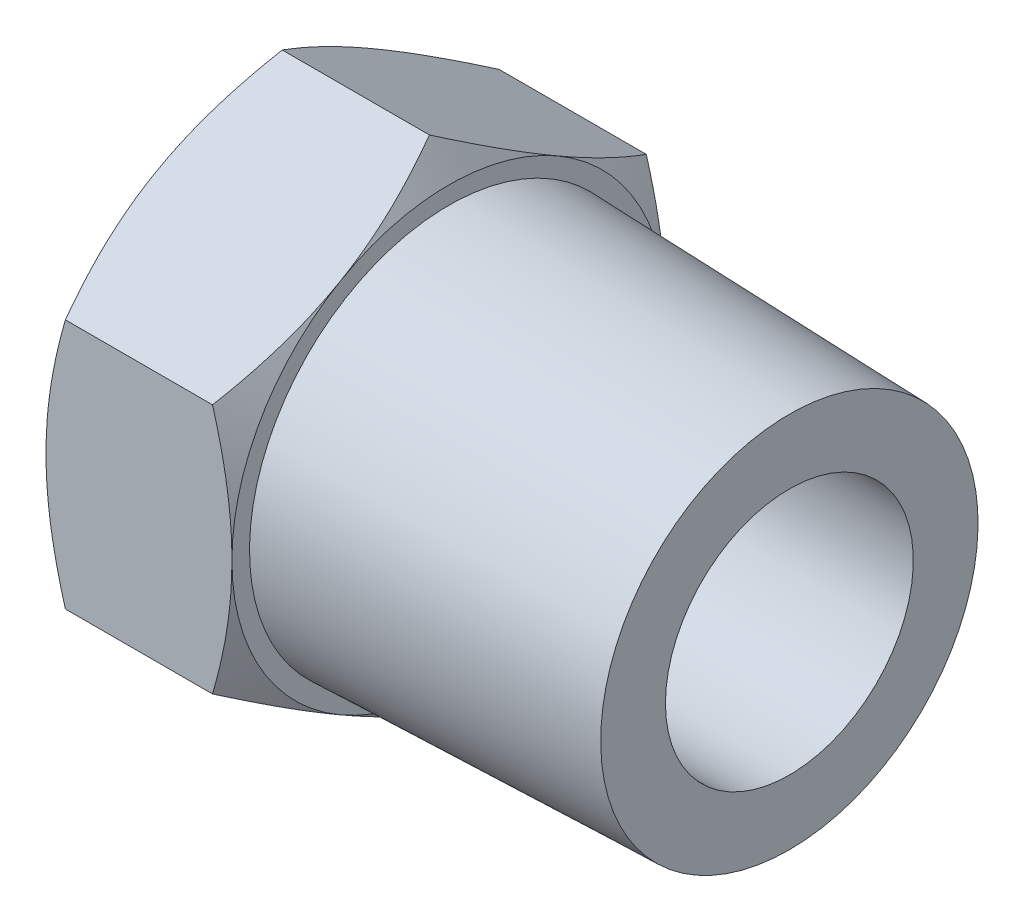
ISO-10303-21;
HEADER;
FILE_DESCRIPTION(('STEP AP214'),'2;1');
FILE_NAME('part.step','',(''),(''),'','','');
FILE_SCHEMA(('AUTOMOTIVE_DESIGN { 1 0 10303 214 1 1 1 1 }'));
ENDSEC;
DATA;
#1=APPLICATION_CONTEXT('core data for automotive mechanical design processes');
#2=APPLICATION_PROTOCOL_DEFINITION('international standard','automotive_design',2000,#1);
#3=PRODUCT_CONTEXT('',#1,'mechanical');
#4=PRODUCT('Part','Part','',(#3));
#5=PRODUCT_RELATED_PRODUCT_CATEGORY('part','',(#4));
#6=PRODUCT_DEFINITION_FORMATION('','',#4);
#7=PRODUCT_DEFINITION_CONTEXT('part definition',#1,'design');
#8=PRODUCT_DEFINITION('design','',#6,#7);
#9=PRODUCT_DEFINITION_SHAPE('','',#8);
#10=(LENGTH_UNIT() NAMED_UNIT(*) SI_UNIT(.MILLI.,.METRE.));
#11=(NAMED_UNIT(*) PLANE_ANGLE_UNIT() SI_UNIT($,.RADIAN.));
#12=(NAMED_UNIT(*) SI_UNIT($,.STERADIAN.) SOLID_ANGLE_UNIT());
#13=UNCERTAINTY_MEASURE_WITH_UNIT(LENGTH_MEASURE(1.E-05),#10,'distance_accuracy_value','');
#14=(GEOMETRIC_REPRESENTATION_CONTEXT(3) GLOBAL_UNCERTAINTY_ASSIGNED_CONTEXT((#13)) GLOBAL_UNIT_ASSIGNED_CONTEXT((#10,
#11,#12)) REPRESENTATION_CONTEXT('',''));
#15=CARTESIAN_POINT('',(0.,0.,0.));
#16=DIRECTION('',(0.,0.,1.));
#17=DIRECTION('',(1.,0.,0.));
#18=AXIS2_PLACEMENT_3D('',#15,#16,#17);
#19=CARTESIAN_POINT('',(13.4874,-4.891175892,4.891175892));
#20=DIRECTION('',(1.,0.,0.));
#21=DIRECTION('',(0.,0.,-1.));
#22=AXIS2_PLACEMENT_3D('',#19,#20,#21);
#23=PLANE('',#22);
#24=CARTESIAN_POINT('',(13.4874,0.,0.));
#25=DIRECTION('',(-1.,0.,0.));
#26=DIRECTION('',(0.,-1.,0.));
#27=AXIS2_PLACEMENT_3D('',#24,#25,#26);
#28=CIRCLE('',#27,4.8331777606);
#29=CARTESIAN_POINT('',(13.4874,-4.8331777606,0.));
#30=VERTEX_POINT('',#29);
#31=EDGE_CURVE('E11',#30,#30,#28,.F.);
#32=ORIENTED_EDGE('',*,*,#31,.T.);
#33=EDGE_LOOP('',(#32));
#34=FACE_BOUND('',#33,.T.);
#35=CARTESIAN_POINT('',(13.4874,0.,0.));
#36=DIRECTION('',(-1.,0.,0.));
#37=DIRECTION('',(0.,0.,1.));
#38=AXIS2_PLACEMENT_3D('',#35,#36,#37);
#39=CIRCLE('',#38,3.175);
#40=CARTESIAN_POINT('',(13.4874,0.,3.175));
#41=VERTEX_POINT('',#40);
#42=EDGE_CURVE('E448',#41,#41,#39,.T.);
#43=ORIENTED_EDGE('',*,*,#42,.T.);
#44=EDGE_LOOP('',(#43));
#45=FACE_BOUND('',#44,.T.);
#46=ADVANCED_FACE('F32',(#34,#45),#23,.T.);
#47=CARTESIAN_POINT('',(4.791075,3.2079024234,5.55625));
#48=DIRECTION('',(0.,0.866025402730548,0.500000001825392));
#49=DIRECTION('',(0.,0.500000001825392,-0.866025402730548));
#50=AXIS2_PLACEMENT_3D('',#47,#48,#49);
#51=PLANE('',#50);
#52=CARTESIAN_POINT('',(4.76250000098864,4.81185364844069,2.7781249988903));
#53=CARTESIAN_POINT('',(4.762522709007,4.87993238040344,2.66020917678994));
#54=CARTESIAN_POINT('',(4.75961098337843,4.94800783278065,2.54229903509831));
#55=CARTESIAN_POINT('',(4.74808744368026,5.08402507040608,2.30671026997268));
#56=CARTESIAN_POINT('',(4.7394767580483,5.15196687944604,2.18903160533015));
#57=CARTESIAN_POINT('',(4.71678077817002,5.28727798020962,1.95466590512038));
#58=CARTESIAN_POINT('',(4.70272304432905,5.35464843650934,1.83797685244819));
#59=CARTESIAN_POINT('',(4.66943535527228,5.4890683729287,1.60515469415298));
#60=CARTESIAN_POINT('',(4.65020526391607,5.5561178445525,1.48902160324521));
#61=CARTESIAN_POINT('',(4.58535052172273,5.75650685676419,1.14193765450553));
#62=CARTESIAN_POINT('',(4.53252991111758,5.88926425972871,0.911995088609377));
#63=CARTESIAN_POINT('',(4.41071207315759,6.15363741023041,0.45408736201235));
#64=CARTESIAN_POINT('',(4.34163405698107,6.28524393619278,0.226138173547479));
#65=CARTESIAN_POINT('',(4.26623574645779,6.41580488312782,-1.8927537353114E-08));
#66=B_SPLINE_CURVE_WITH_KNOTS('',3,(#52,#53,#54,#55,#56,#57,#58,#59,#60,#61,#62,#63,#64,#65),
.UNSPECIFIED.,.F.,.F.,(4,2,2,2,2,2,4),(0.,0.408430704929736,0.81678056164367,1.22309071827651,
1.6294115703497,2.44098831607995,3.25668655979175),.UNSPECIFIED.);
#67=CARTESIAN_POINT('',(4.76250000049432,4.8118536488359,2.77812499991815));
#68=VERTEX_POINT('',#67);
#69=CARTESIAN_POINT('',(4.26623576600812,6.41580484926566,-3.97234481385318E-08));
#70=VERTEX_POINT('',#69);
#71=EDGE_CURVE('E342',#68,#70,#66,.T.);
#72=ORIENTED_EDGE('',*,*,#71,.T.);
#73=DIRECTION('',(1.,0.,0.));
#74=VECTOR('',#73,1.);
#75=CARTESIAN_POINT('',(2.38125,6.4158048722,0.));
#76=LINE('',#75,#74);
#77=CARTESIAN_POINT('',(0.49626424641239,6.4158048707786,2.46192904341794E-09));
#78=VERTEX_POINT('',#77);
#79=EDGE_CURVE('E352',#78,#70,#76,.T.);
#80=ORIENTED_EDGE('',*,*,#79,.F.);
#81=CARTESIAN_POINT('',(0.496264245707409,6.41580486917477,4.85708082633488E-09));
#82=CARTESIAN_POINT('',(0.420865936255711,6.28524392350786,0.226138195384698));
#83=CARTESIAN_POINT('',(0.351787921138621,6.15363739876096,0.45408738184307));
#84=CARTESIAN_POINT('',(0.22997008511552,5.88926425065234,0.911995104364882));
#85=CARTESIAN_POINT('',(0.177149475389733,5.75650684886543,1.14193766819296));
#86=CARTESIAN_POINT('',(0.112294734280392,5.55611783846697,1.48902161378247));
#87=CARTESIAN_POINT('',(0.0930646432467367,5.48906836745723,1.60515470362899));
#88=CARTESIAN_POINT('',(0.0597769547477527,5.35464843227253,1.83797685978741));
#89=CARTESIAN_POINT('',(0.0457192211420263,5.28727797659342,1.95466591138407));
#90=CARTESIAN_POINT('',(0.0230232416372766,5.1519668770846,2.18903160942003));
#91=CARTESIAN_POINT('',(0.0144125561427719,5.08402506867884,2.30671027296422));
#92=CARTESIAN_POINT('',(0.00288901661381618,4.94800783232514,2.5422990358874));
#93=CARTESIAN_POINT('',(-2.27089830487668E-05,4.87993238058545,2.66020917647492));
#94=CARTESIAN_POINT('',(-9.88643838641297E-10,4.81185364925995,2.7781249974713));
#95=B_SPLINE_CURVE_WITH_KNOTS('',3,(#81,#82,#83,#84,#85,#86,#87,#88,#89,#90,#91,#92,#93,#94),
.UNSPECIFIED.,.F.,.F.,(4,2,2,2,2,2,4),(0.,0.815698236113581,1.62727497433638,2.03359582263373,
2.43990597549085,2.84825582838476,3.25668652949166),.UNSPECIFIED.);
#96=CARTESIAN_POINT('',(0.,4.81185364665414,2.77812500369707));
#97=VERTEX_POINT('',#96);
#98=EDGE_CURVE('E384',#78,#97,#95,.T.);
#99=ORIENTED_EDGE('',*,*,#98,.T.);
#100=CARTESIAN_POINT('',(-9.88643837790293E-10,4.81185364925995,2.7781249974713));
#101=CARTESIAN_POINT('',(-2.27093693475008E-05,4.74377491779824,2.89604081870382));
#102=CARTESIAN_POINT('',(0.00288901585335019,4.67569946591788,3.01395095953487));
#103=CARTESIAN_POINT('',(0.0144125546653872,4.53968222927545,3.2495397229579));
#104=CARTESIAN_POINT('',(0.0230232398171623,4.47174042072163,3.36721838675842));
#105=CARTESIAN_POINT('',(0.0457192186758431,4.33642932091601,3.60158408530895));
#106=CARTESIAN_POINT('',(0.0597769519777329,4.26905886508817,3.71827313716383));
#107=CARTESIAN_POINT('',(0.0930646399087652,4.13463892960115,3.95109529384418));
#108=CARTESIAN_POINT('',(0.112294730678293,4.06758945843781,4.0672283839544));
#109=CARTESIAN_POINT('',(0.177149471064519,3.86720044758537,4.41431233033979));
#110=CARTESIAN_POINT('',(0.229970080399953,3.73444304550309,4.64425489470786));
#111=CARTESIAN_POINT('',(0.351787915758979,3.4700698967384,5.1021626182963));
#112=CARTESIAN_POINT('',(0.420865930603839,3.33846337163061,5.33011180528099));
#113=CARTESIAN_POINT('',(0.496264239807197,3.20790242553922,5.55624999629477));
#114=B_SPLINE_CURVE_WITH_KNOTS('',3,(#100,#101,#102,#103,#104,#105,#106,#107,#108,#109,#110,
#111,#112,#113),.UNSPECIFIED.,.F.,.F.,(4,2,2,2,2,2,4),(0.,0.408430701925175,0.816780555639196,
1.22309070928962,1.62941155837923,2.44098829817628,3.25668653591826),.UNSPECIFIED.);
#115=CARTESIAN_POINT('',(0.496264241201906,3.20790242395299,5.55625));
#116=VERTEX_POINT('',#115);
#117=EDGE_CURVE('E205',#97,#116,#114,.T.);
#118=ORIENTED_EDGE('',*,*,#117,.T.);
#119=DIRECTION('',(-1.,0.,0.));
#120=VECTOR('',#119,1.);
#121=CARTESIAN_POINT('',(2.38125,3.2079024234,5.55625));
#122=LINE('',#121,#120);
#123=CARTESIAN_POINT('',(4.26623578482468,3.20790246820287,5.55624992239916));
#124=VERTEX_POINT('',#123);
#125=EDGE_CURVE('E127',#124,#116,#122,.T.);
#126=ORIENTED_EDGE('',*,*,#125,.F.);
#127=CARTESIAN_POINT('',(4.26623581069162,3.20790251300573,5.55624984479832));
#128=CARTESIAN_POINT('',(4.34163411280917,3.33846345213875,5.3301116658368));
#129=CARTESIAN_POINT('',(4.41071212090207,3.47006997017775,5.10216249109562));
#130=CARTESIAN_POINT('',(4.53252994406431,3.73444310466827,4.64425479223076));
#131=CARTESIAN_POINT('',(4.58535054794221,3.86720049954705,4.41431224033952));
#132=CARTESIAN_POINT('',(4.65020528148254,4.06758949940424,4.06722831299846));
#133=CARTESIAN_POINT('',(4.66943537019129,4.13463896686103,3.95109522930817));
#134=CARTESIAN_POINT('',(4.70272305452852,4.26905889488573,3.71827308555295));
#135=CARTESIAN_POINT('',(4.71678078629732,4.3364293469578,3.60158404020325));
#136=CARTESIAN_POINT('',(4.73947676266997,4.47174043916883,3.36721835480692));
#137=CARTESIAN_POINT('',(4.74808744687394,4.53968224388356,3.24953969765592));
#138=CARTESIAN_POINT('',(4.7596109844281,4.67569947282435,3.01395094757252));
#139=CARTESIAN_POINT('',(4.7625227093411,4.74377492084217,2.8960408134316));
#140=CARTESIAN_POINT('',(4.76250000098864,4.81185364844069,2.7781249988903));
#141=B_SPLINE_CURVE_WITH_KNOTS('',3,(#127,#128,#129,#130,#131,#132,#133,#134,#135,#136,#137,
#138,#139,#140),.UNSPECIFIED.,.F.,.F.,(4,2,2,2,2,2,4),(0.,0.815698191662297,1.62727488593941,
2.03359571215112,2.43990584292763,2.84825567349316,3.25668635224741),.UNSPECIFIED.);
#142=EDGE_CURVE('E337',#124,#68,#141,.T.);
#143=ORIENTED_EDGE('',*,*,#142,.T.);
#144=EDGE_LOOP('',(#72,#80,#99,#118,#126,#143));
#145=FACE_BOUND('',#144,.T.);
#146=ADVANCED_FACE('F311',(#145),#51,.T.);
#147=CARTESIAN_POINT('',(4.791075,6.4158048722,0.));
#148=DIRECTION('',(0.,0.866025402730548,-0.500000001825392));
#149=DIRECTION('',(0.,-0.500000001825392,-0.866025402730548));
#150=AXIS2_PLACEMENT_3D('',#147,#148,#149);
#151=PLANE('',#150);
#152=CARTESIAN_POINT('',(4.76250000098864,4.81185364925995,-2.7781249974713));
#153=CARTESIAN_POINT('',(4.76252270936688,4.74377491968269,-2.89604081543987));
#154=CARTESIAN_POINT('',(4.75961098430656,4.67569946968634,-3.01395095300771));
#155=CARTESIAN_POINT('',(4.74808744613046,4.53968223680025,-3.24953970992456));
#156=CARTESIAN_POINT('',(4.73947676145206,4.47174043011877,-3.36721837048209));
#157=CARTESIAN_POINT('',(4.7167807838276,4.33642933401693,-3.60158406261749));
#158=CARTESIAN_POINT('',(4.70272305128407,4.26905888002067,-3.71827311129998));
#159=CARTESIAN_POINT('',(4.66943536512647,4.13463894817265,-3.95109526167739));
#160=CARTESIAN_POINT('',(4.65020527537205,4.06758947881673,-4.06722834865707));
#161=CARTESIAN_POINT('',(4.58535053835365,3.86720047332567,-4.41431228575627));
#162=CARTESIAN_POINT('',(4.53252993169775,3.73444307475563,-4.64425484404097));
#163=CARTESIAN_POINT('',(4.41071210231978,3.4700699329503,-5.10216255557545));
#164=CARTESIAN_POINT('',(4.34163409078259,3.33846341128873,-5.33011173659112));
#165=CARTESIAN_POINT('',(4.26623578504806,3.20790246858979,-5.55624992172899));
#166=B_SPLINE_CURVE_WITH_KNOTS('',3,(#152,#153,#154,#155,#156,#157,#158,#159,#160,#161,#162,
#163,#164,#165),.UNSPECIFIED.,.F.,.F.,(4,2,2,2,2,2,4),(0.,0.40843069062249,0.816780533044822,
1.22309067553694,1.62941151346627,2.44098823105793,3.25668644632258),.UNSPECIFIED.);
#167=CARTESIAN_POINT('',(4.76250000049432,4.81185365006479,-2.77812499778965));
#168=VERTEX_POINT('',#167);
#169=CARTESIAN_POINT('',(4.26623575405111,3.20790244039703,-5.55625));
#170=VERTEX_POINT('',#169);
#171=EDGE_CURVE('E297',#168,#170,#166,.T.);
#172=ORIENTED_EDGE('',*,*,#171,.T.);
#173=DIRECTION('',(1.,0.,0.));
#174=VECTOR('',#173,1.);
#175=CARTESIAN_POINT('',(2.38125,3.2079024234,-5.55625));
#176=LINE('',#175,#174);
#177=CARTESIAN_POINT('',(0.496264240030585,3.2079024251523,-5.55624999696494));
#178=VERTEX_POINT('',#177);
#179=EDGE_CURVE('E387',#178,#170,#176,.T.);
#180=ORIENTED_EDGE('',*,*,#179,.F.);
#181=CARTESIAN_POINT('',(0.496264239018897,3.20790242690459,-5.55624999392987));
#182=CARTESIAN_POINT('',(0.420865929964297,3.33846337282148,-5.33011180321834));
#183=CARTESIAN_POINT('',(0.351787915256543,3.47006989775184,-5.10216261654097));
#184=CARTESIAN_POINT('',(0.229970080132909,3.73444304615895,-4.64425489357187));
#185=CARTESIAN_POINT('',(0.177149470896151,3.86720044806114,-4.41431232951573));
#186=CARTESIAN_POINT('',(0.112294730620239,4.06758945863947,-4.0672283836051));
#187=CARTESIAN_POINT('',(0.0930646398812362,4.13463892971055,-3.95109529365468));
#188=CARTESIAN_POINT('',(0.0597769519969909,4.26905886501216,-3.71827313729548));
#189=CARTESIAN_POINT('',(0.0457192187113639,4.33642932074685,-3.60158408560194));
#190=CARTESIAN_POINT('',(0.0230232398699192,4.47174042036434,-3.36721838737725));
#191=CARTESIAN_POINT('',(0.014412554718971,4.53968222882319,-3.24953972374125));
#192=CARTESIAN_POINT('',(0.00288901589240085,4.67569946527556,-3.0139509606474));
#193=CARTESIAN_POINT('',(-2.27093456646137E-05,4.74377491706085,-2.89604081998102));
#194=CARTESIAN_POINT('',(-9.88643837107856E-10,4.81185364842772,-2.77812499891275));
#195=B_SPLINE_CURVE_WITH_KNOTS('',3,(#181,#182,#183,#184,#185,#186,#187,#188,#189,#190,#191,
#192,#193,#194),.UNSPECIFIED.,.F.,.F.,(4,2,2,2,2,2,4),(0.,0.815698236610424,1.62727497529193,
2.03359582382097,2.43990597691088,2.84825583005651,3.25668653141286),.UNSPECIFIED.);
#196=CARTESIAN_POINT('',(-4.94322106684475E-10,4.81185364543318,-2.77812500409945));
#197=VERTEX_POINT('',#196);
#198=EDGE_CURVE('E317',#178,#197,#195,.T.);
#199=ORIENTED_EDGE('',*,*,#198,.T.);
#200=CARTESIAN_POINT('',(-9.88643962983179E-10,4.81185364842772,-2.77812499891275));
#201=CARTESIAN_POINT('',(-2.27090066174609E-05,4.87993237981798,-2.66020917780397));
#202=CARTESIAN_POINT('',(0.00288901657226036,4.94800783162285,-2.54229903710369));
#203=CARTESIAN_POINT('',(0.0144125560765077,5.08402506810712,-2.30671027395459));
#204=CARTESIAN_POINT('',(0.0230232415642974,5.15196687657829,-2.18903161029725));
#205=CARTESIAN_POINT('',(0.045719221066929,5.28727797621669,-1.95466591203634));
#206=CARTESIAN_POINT('',(0.0597769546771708,5.35464843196,-1.83797686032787));
#207=CARTESIAN_POINT('',(0.0930646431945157,5.48906836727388,-1.60515470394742));
#208=CARTESIAN_POINT('',(0.112294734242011,5.55611783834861,-1.48902161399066));
#209=CARTESIAN_POINT('',(0.1771494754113,5.75650684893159,-1.14193766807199));
#210=CARTESIAN_POINT('',(0.229970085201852,5.88926425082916,-0.911995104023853));
#211=CARTESIAN_POINT('',(0.351787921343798,6.15363739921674,-0.454087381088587));
#212=CARTESIAN_POINT('',(0.420865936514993,6.28524392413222,-0.226138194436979));
#213=CARTESIAN_POINT('',(0.496264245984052,6.4158048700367,-3.74694415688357E-09));
#214=B_SPLINE_CURVE_WITH_KNOTS('',3,(#200,#201,#202,#203,#204,#205,#206,#207,#208,#209,#210,
#211,#212,#213),.UNSPECIFIED.,.F.,.F.,(4,2,2,2,2,2,4),(0.,0.408430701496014,0.816780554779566,
1.22309070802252,1.62941155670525,2.44098829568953,3.25668653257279),.UNSPECIFIED.);
#215=EDGE_CURVE('E204',#197,#78,#214,.T.);
#216=ORIENTED_EDGE('',*,*,#215,.T.);
#217=ORIENTED_EDGE('',*,*,#79,.T.);
#218=CARTESIAN_POINT('',(4.26623578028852,6.41580482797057,-8.00469063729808E-08));
#219=CARTESIAN_POINT('',(4.34163408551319,6.28524388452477,-0.226138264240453));
#220=CARTESIAN_POINT('',(4.41071209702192,6.15363736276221,-0.454087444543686));
#221=CARTESIAN_POINT('',(4.53252992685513,5.88926422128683,-0.911995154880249));
#222=CARTESIAN_POINT('',(4.58535053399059,5.7565068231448,-1.14193771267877));
#223=CARTESIAN_POINT('',(4.6502052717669,5.55611781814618,-1.48902164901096));
#224=CARTESIAN_POINT('',(4.66943536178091,5.48906834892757,-1.60515473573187));
#225=CARTESIAN_POINT('',(4.70272304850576,5.35464841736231,-1.83797688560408));
#226=CARTESIAN_POINT('',(4.71678078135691,5.28727796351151,-1.95466593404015));
#227=CARTESIAN_POINT('',(4.73947675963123,5.15196686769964,-2.18903162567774));
#228=CARTESIAN_POINT('',(4.74808744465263,5.08402506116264,-2.3067102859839));
#229=CARTESIAN_POINT('',(4.75961098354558,4.94800782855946,-2.54229904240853));
#230=CARTESIAN_POINT('',(4.76252270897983,4.87993237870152,-2.66020917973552));
#231=CARTESIAN_POINT('',(4.76250000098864,4.81185364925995,-2.7781249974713));
#232=B_SPLINE_CURVE_WITH_KNOTS('',3,(#218,#219,#220,#221,#222,#223,#224,#225,#226,#227,#228,
#229,#230,#231),.UNSPECIFIED.,.F.,.F.,(4,2,2,2,2,2,4),(0.,0.815698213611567,1.62727492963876,
2.03359576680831,2.43990590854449,2.8482557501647,3.25668643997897),.UNSPECIFIED.);
#233=EDGE_CURVE('E303',#70,#168,#232,.T.);
#234=ORIENTED_EDGE('',*,*,#233,.T.);
#235=EDGE_LOOP('',(#172,#180,#199,#216,#217,#234));
#236=FACE_BOUND('',#235,.T.);
#237=ADVANCED_FACE('F308',(#236),#151,.T.);
#238=CARTESIAN_POINT('',(4.791075,-3.2079024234,-5.55625));
#239=DIRECTION('',(0.,0.,-1.));
#240=DIRECTION('',(-1.,0.,0.));
#241=AXIS2_PLACEMENT_3D('',#238,#239,#240);
#242=PLANE('',#241);
#243=CARTESIAN_POINT('',(4.7625,-1.13960469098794E-09,-5.55625));
#244=CARTESIAN_POINT('',(4.76252270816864,-0.136157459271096,-5.55625));
#245=CARTESIAN_POINT('',(4.75961098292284,-0.27230835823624,-5.55625));
#246=CARTESIAN_POINT('',(4.74808744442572,-0.544342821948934,-5.55625));
#247=CARTESIAN_POINT('',(4.73947675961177,-0.680226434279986,-5.55625));
#248=CARTESIAN_POINT('',(4.71678078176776,-0.950848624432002,-5.55625));
#249=CARTESIAN_POINT('',(4.70272304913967,-1.08558953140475,-5.55625));
#250=CARTESIAN_POINT('',(4.66943536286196,-1.35442939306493,-5.55625));
#251=CARTESIAN_POINT('',(4.65020527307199,-1.48852833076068,-5.55625));
#252=CARTESIAN_POINT('',(4.58535053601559,-1.88930633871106,-5.55625));
#253=CARTESIAN_POINT('',(4.53252992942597,-2.1548211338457,-5.55625));
#254=CARTESIAN_POINT('',(4.41071210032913,-2.683567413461,-5.55625));
#255=CARTESIAN_POINT('',(4.34163408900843,-2.94678045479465,-5.55625));
#256=CARTESIAN_POINT('',(4.26623578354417,-3.20790233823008,-5.55625));
#257=B_SPLINE_CURVE_WITH_KNOTS('',3,(#243,#244,#245,#246,#247,#248,#249,#250,#251,#252,#253,
#254,#255,#256),.UNSPECIFIED.,.F.,.F.,(4,2,2,2,2,2,4),(0.,0.408430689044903,0.816780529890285,
1.22309067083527,1.62941150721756,2.44098822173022,3.2566864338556),.UNSPECIFIED.);
#258=CARTESIAN_POINT('',(4.7625,-1.70940703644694E-09,-5.55625));
#259=VERTEX_POINT('',#258);
#260=CARTESIAN_POINT('',(4.2662357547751,-3.20790241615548,-5.55625001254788));
#261=VERTEX_POINT('',#260);
#262=EDGE_CURVE('E271',#259,#261,#257,.T.);
#263=ORIENTED_EDGE('',*,*,#262,.T.);
#264=DIRECTION('',(1.,0.,0.));
#265=VECTOR('',#264,1.);
#266=CARTESIAN_POINT('',(2.38125,-3.2079024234,-5.55625));
#267=LINE('',#266,#265);
#268=CARTESIAN_POINT('',(0.496264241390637,-3.20790242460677,-5.55625));
#269=VERTEX_POINT('',#268);
#270=EDGE_CURVE('E392',#269,#261,#267,.T.);
#271=ORIENTED_EDGE('',*,*,#270,.F.);
#272=CARTESIAN_POINT('',(0.496264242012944,-3.20790242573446,-5.55624999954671));
#273=CARTESIAN_POINT('',(0.420865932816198,-2.94678053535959,-5.55624999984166));
#274=CARTESIAN_POINT('',(0.351787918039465,-2.68356748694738,-5.55624999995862));
#275=CARTESIAN_POINT('',(0.229970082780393,-2.15482119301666,-5.55625000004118));
#276=CARTESIAN_POINT('',(0.177149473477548,-1.88930639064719,-5.55625000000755));
#277=CARTESIAN_POINT('',(0.112294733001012,-1.48852837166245,-5.55624999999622));
#278=CARTESIAN_POINT('',(0.0930646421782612,-1.35442943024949,-5.55624999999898));
#279=CARTESIAN_POINT('',(0.0597769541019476,-1.08558956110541,-5.55625000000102));
#280=CARTESIAN_POINT('',(0.0457192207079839,-0.950848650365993,-5.55625000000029));
#281=CARTESIAN_POINT('',(0.023023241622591,-0.68022645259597,-5.55624999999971));
#282=CARTESIAN_POINT('',(0.0144125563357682,-0.544342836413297,-5.55624999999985));
#283=CARTESIAN_POINT('',(0.00288901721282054,-0.272308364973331,-5.55625000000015));
#284=CARTESIAN_POINT('',(-2.27081857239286E-05,-0.136157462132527,-5.55625000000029));
#285=CARTESIAN_POINT('',(0.,-1.24729537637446E-10,-5.55625));
#286=B_SPLINE_CURVE_WITH_KNOTS('',3,(#272,#273,#274,#275,#276,#277,#278,#279,#280,#281,#282,
#283,#284,#285),.UNSPECIFIED.,.F.,.F.,(4,2,2,2,2,2,4),(0.,0.815698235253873,1.62727497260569,
2.03359582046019,2.43990597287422,2.84825582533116,3.25668652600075),.UNSPECIFIED.);
#287=CARTESIAN_POINT('',(0.,-6.23646473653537E-11,-5.55625));
#288=VERTEX_POINT('',#287);
#289=EDGE_CURVE('E124',#269,#288,#286,.T.);
#290=ORIENTED_EDGE('',*,*,#289,.T.);
#291=CARTESIAN_POINT('',(0.,-1.24729294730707E-10,-5.55625));
#292=CARTESIAN_POINT('',(-2.27081891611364E-05,0.13615746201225,-5.55625));
#293=CARTESIAN_POINT('',(0.00288901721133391,0.272308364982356,-5.55625));
#294=CARTESIAN_POINT('',(0.0144125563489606,0.544342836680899,-5.55625));
#295=CARTESIAN_POINT('',(0.023023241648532,0.680226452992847,-5.55625));
#296=CARTESIAN_POINT('',(0.0457192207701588,0.950848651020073,-5.55625));
#297=CARTESIAN_POINT('',(0.0597769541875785,1.08558956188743,-5.55625));
#298=CARTESIAN_POINT('',(0.0930646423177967,1.35442943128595,-5.55625));
#299=CARTESIAN_POINT('',(0.112294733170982,1.48852837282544,-5.55625));
#300=CARTESIAN_POINT('',(0.177149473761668,1.88930639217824,-5.55625));
#301=CARTESIAN_POINT('',(0.229970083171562,2.1548211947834,-5.55625));
#302=CARTESIAN_POINT('',(0.351787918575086,2.68356748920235,-5.55625));
#303=CARTESIAN_POINT('',(0.420865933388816,2.94678053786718,-5.55625));
#304=CARTESIAN_POINT('',(0.496264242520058,3.2079024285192,-5.55625));
#305=B_SPLINE_CURVE_WITH_KNOTS('',3,(#291,#292,#293,#294,#295,#296,#297,#298,#299,#300,#301,
#302,#303,#304),.UNSPECIFIED.,.F.,.F.,(4,2,2,2,2,2,4),(0.,0.408430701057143,0.816780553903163,
1.22309070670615,1.6294115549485,2.44098829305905,3.2566865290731),.UNSPECIFIED.);
#306=EDGE_CURVE('E323',#288,#178,#305,.T.);
#307=ORIENTED_EDGE('',*,*,#306,.T.);
#308=ORIENTED_EDGE('',*,*,#179,.T.);
#309=CARTESIAN_POINT('',(4.26623572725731,3.20790245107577,-5.55624996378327));
#310=CARTESIAN_POINT('',(4.34163405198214,2.94678056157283,-5.55624998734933));
#311=CARTESIAN_POINT('',(4.41071207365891,2.68356751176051,-5.55624999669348));
#312=CARTESIAN_POINT('',(4.5325299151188,2.15482121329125,-5.55625000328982));
#313=CARTESIAN_POINT('',(4.5853505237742,1.88930640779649,-5.55625000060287));
#314=CARTESIAN_POINT('',(4.65020526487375,1.4885283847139,-5.55624999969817));
#315=CARTESIAN_POINT('',(4.66943535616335,1.3544294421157,-5.55624999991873));
#316=CARTESIAN_POINT('',(4.70272304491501,1.08558957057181,-5.55625000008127));
#317=CARTESIAN_POINT('',(4.71678077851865,0.950848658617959,-5.55625000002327));
#318=CARTESIAN_POINT('',(4.73947675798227,0.68022645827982,-5.55624999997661));
#319=CARTESIAN_POINT('',(4.748087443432,0.544342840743,-5.55624999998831));
#320=CARTESIAN_POINT('',(4.75961098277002,0.272308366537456,-5.5562500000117));
#321=CARTESIAN_POINT('',(4.76252270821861,0.136157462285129,-5.5562500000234));
#322=CARTESIAN_POINT('',(4.7625,-1.13960505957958E-09,-5.55625));
#323=B_SPLINE_CURVE_WITH_KNOTS('',3,(#309,#310,#311,#312,#313,#314,#315,#316,#317,#318,#319,
#320,#321,#322),.UNSPECIFIED.,.F.,.F.,(4,2,2,2,2,2,4),(0.,0.815698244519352,1.62727499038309,
2.03359584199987,2.43990599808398,2.84825585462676,3.25668655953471),.UNSPECIFIED.);
#324=EDGE_CURVE('E292',#170,#259,#323,.T.);
#325=ORIENTED_EDGE('',*,*,#324,.T.);
#326=EDGE_LOOP('',(#263,#271,#290,#307,#308,#325));
#327=FACE_BOUND('',#326,.T.);
#328=ADVANCED_FACE('F253',(#327),#242,.T.);
#329=CARTESIAN_POINT('',(4.791075,-3.2079024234,-5.55625));
#330=DIRECTION('',(0.,-0.866025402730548,-0.500000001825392));
#331=DIRECTION('',(0.,-0.500000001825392,0.866025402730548));
#332=AXIS2_PLACEMENT_3D('',#329,#330,#331);
#333=PLANE('',#332);
#334=CARTESIAN_POINT('',(4.76250000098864,-4.81185364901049,-2.77812499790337));
#335=CARTESIAN_POINT('',(4.76252270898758,-4.87993237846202,-2.66020918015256));
#336=CARTESIAN_POINT('',(4.75961098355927,-4.94800782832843,-2.54229904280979));
#337=CARTESIAN_POINT('',(4.74808744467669,-5.08402506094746,-2.3067102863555));
#338=CARTESIAN_POINT('',(4.73947675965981,-5.15196686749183,-2.18903162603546));
#339=CARTESIAN_POINT('',(4.71678078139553,-5.28727796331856,-1.95466593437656));
#340=CARTESIAN_POINT('',(4.70272304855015,-5.35464841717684,-1.83797688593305));
#341=CARTESIAN_POINT('',(4.66943536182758,-5.48906834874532,-1.60515473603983));
#342=CARTESIAN_POINT('',(4.65020527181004,-5.55611781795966,-1.48902164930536));
#343=CARTESIAN_POINT('',(4.58535053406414,-5.75650682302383,-1.14193771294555));
#344=CARTESIAN_POINT('',(4.53252992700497,-5.88926422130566,-0.911995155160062));
#345=CARTESIAN_POINT('',(4.41071209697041,-6.15363736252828,-0.45408744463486));
#346=CARTESIAN_POINT('',(4.34163408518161,-6.28524388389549,-0.226138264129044));
#347=CARTESIAN_POINT('',(4.26623577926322,-6.41580482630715,-7.94887462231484E-08));
#348=B_SPLINE_CURVE_WITH_KNOTS('',3,(#334,#335,#336,#337,#338,#339,#340,#341,#342,#343,#344,
#345,#346,#347),.UNSPECIFIED.,.F.,.F.,(4,2,2,2,2,2,4),(0.,0.408430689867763,0.816780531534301,
1.22309067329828,1.62941151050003,2.44098822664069,3.25668644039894),.UNSPECIFIED.);
#349=CARTESIAN_POINT('',(4.76250000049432,-4.81185364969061,-2.77812499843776));
#350=VERTEX_POINT('',#349);
#351=CARTESIAN_POINT('',(4.26623574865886,-6.41580487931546,-1.23243365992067E-08));
#352=VERTEX_POINT('',#351);
#353=EDGE_CURVE('E258',#350,#352,#348,.T.);
#354=ORIENTED_EDGE('',*,*,#353,.T.);
#355=DIRECTION('',(1.,0.,0.));
#356=VECTOR('',#355,1.);
#357=CARTESIAN_POINT('',(2.38125,-6.4158048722,0.));
#358=LINE('',#357,#356);
#359=CARTESIAN_POINT('',(0.496264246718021,-6.41580487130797,-1.54503742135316E-09));
#360=VERTEX_POINT('',#359);
#361=EDGE_CURVE('E146',#360,#352,#358,.T.);
#362=ORIENTED_EDGE('',*,*,#361,.F.);
#363=CARTESIAN_POINT('',(0.496264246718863,-6.41580486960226,-2.79224623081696E-09));
#364=CARTESIAN_POINT('',(0.420865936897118,-6.28524392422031,-0.226138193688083));
#365=CARTESIAN_POINT('',(0.351787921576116,-6.15363739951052,-0.454087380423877));
#366=CARTESIAN_POINT('',(0.229970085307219,-5.88926425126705,-0.911995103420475));
#367=CARTESIAN_POINT('',(0.177149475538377,-5.75650684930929,-1.14193766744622));
#368=CARTESIAN_POINT('',(0.11229473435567,-5.55611783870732,-1.48902161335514));
#369=CARTESIAN_POINT('',(0.0930646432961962,-5.48906836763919,-1.60515470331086));
#370=CARTESIAN_POINT('',(0.0597769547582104,-5.35464843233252,-1.83797685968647));
#371=CARTESIAN_POINT('',(0.0457192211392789,-5.28727797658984,-1.95466591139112));
#372=CARTESIAN_POINT('',(0.0230232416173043,-5.15196687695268,-2.18903160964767));
#373=CARTESIAN_POINT('',(0.0144125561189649,-5.08402506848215,-2.30671027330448));
#374=CARTESIAN_POINT('',(0.00288901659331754,-4.94800783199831,-2.54229903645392));
#375=CARTESIAN_POINT('',(-2.27089963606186E-05,-4.87993238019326,-2.66020917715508));
#376=CARTESIAN_POINT('',(-9.88643713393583E-10,-4.81185364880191,-2.77812499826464));
#377=B_SPLINE_CURVE_WITH_KNOTS('',3,(#363,#364,#365,#366,#367,#368,#369,#370,#371,#372,#373,
#374,#375,#376),.UNSPECIFIED.,.F.,.F.,(4,2,2,2,2,2,4),(0.,0.815698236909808,1.62727497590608,
2.03359582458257,2.4399059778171,2.84825583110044,3.25668653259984),.UNSPECIFIED.);
#378=CARTESIAN_POINT('',(-4.94321981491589E-10,-4.81185364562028,-2.77812500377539));
#379=VERTEX_POINT('',#378);
#380=EDGE_CURVE('E143',#360,#379,#377,.T.);
#381=ORIENTED_EDGE('',*,*,#380,.T.);
#382=CARTESIAN_POINT('',(-9.88643587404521E-10,-4.81185364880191,-2.77812499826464));
#383=CARTESIAN_POINT('',(-2.27093563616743E-05,-4.74377491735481,-2.89604081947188));
#384=CARTESIAN_POINT('',(0.00288901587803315,-4.67569946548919,-3.01395096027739));
#385=CARTESIAN_POINT('',(0.0144125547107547,-4.53968222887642,-3.24953972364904));
#386=CARTESIAN_POINT('',(0.0230232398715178,-4.47174042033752,-3.3672183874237));
#387=CARTESIAN_POINT('',(0.045719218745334,-4.33642932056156,-3.60158408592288));
#388=CARTESIAN_POINT('',(0.0597769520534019,-4.26905886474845,-3.71827313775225));
#389=CARTESIAN_POINT('',(0.0930646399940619,-4.13463892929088,-3.95109529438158));
#390=CARTESIAN_POINT('',(0.112294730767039,-4.06758945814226,-4.0672283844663));
#391=CARTESIAN_POINT('',(0.177149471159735,-3.86720044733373,-4.41431233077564));
#392=CARTESIAN_POINT('',(0.229970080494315,-3.7344430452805,-4.64425489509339));
#393=CARTESIAN_POINT('',(0.351787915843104,-3.47006989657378,-5.10216261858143));
#394=CARTESIAN_POINT('',(0.420865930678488,-3.3384633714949,-5.33011180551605));
#395=CARTESIAN_POINT('',(0.496264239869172,-3.20790242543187,-5.5562499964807));
#396=B_SPLINE_CURVE_WITH_KNOTS('',3,(#382,#383,#384,#385,#386,#387,#388,#389,#390,#391,#392,
#393,#394,#395),.UNSPECIFIED.,.F.,.F.,(4,2,2,2,2,2,4),(0.,0.408430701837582,0.816780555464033,
1.22309070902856,1.62941155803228,2.44098829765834,3.25668653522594),.UNSPECIFIED.);
#397=EDGE_CURVE('E119',#379,#269,#396,.T.);
#398=ORIENTED_EDGE('',*,*,#397,.T.);
#399=ORIENTED_EDGE('',*,*,#270,.T.);
#400=CARTESIAN_POINT('',(4.2662357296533,-3.20790238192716,-5.55625000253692));
#401=CARTESIAN_POINT('',(4.34163405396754,-3.33846334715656,-5.33011182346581));
#402=CARTESIAN_POINT('',(4.41071207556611,-3.47006988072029,-5.10216263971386));
#403=CARTESIAN_POINT('',(4.53252991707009,-3.73444303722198,-4.6442549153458));
#404=CARTESIAN_POINT('',(4.58535052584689,-3.86720043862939,-4.41431234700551));
#405=CARTESIAN_POINT('',(4.65020526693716,-4.06758945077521,-4.0672283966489));
#406=CARTESIAN_POINT('',(4.66943535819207,-4.13463892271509,-3.95109530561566));
#407=CARTESIAN_POINT('',(4.70272304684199,-4.26905885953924,-3.71827314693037));
#408=CARTESIAN_POINT('',(4.71678078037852,-4.33642931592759,-3.60158409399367));
#409=CARTESIAN_POINT('',(4.73947675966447,-4.47174041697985,-3.36721839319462));
#410=CARTESIAN_POINT('',(4.74808744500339,-4.53968222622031,-3.24953972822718));
#411=CARTESIAN_POINT('',(4.75961098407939,-4.67569946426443,-3.01395096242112));
#412=CARTESIAN_POINT('',(4.76252270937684,-4.74377491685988,-2.89604082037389));
#413=CARTESIAN_POINT('',(4.76250000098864,-4.81185364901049,-2.77812499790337));
#414=B_SPLINE_CURVE_WITH_KNOTS('',3,(#400,#401,#402,#403,#404,#405,#406,#407,#408,#409,#410,
#411,#412,#413),.UNSPECIFIED.,.F.,.F.,(4,2,2,2,2,2,4),(0.,0.815698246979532,1.62727499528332,
2.0335958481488,2.43990600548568,2.84825586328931,3.25668656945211),.UNSPECIFIED.);
#415=EDGE_CURVE('E264',#261,#350,#414,.T.);
#416=ORIENTED_EDGE('',*,*,#415,.T.);
#417=EDGE_LOOP('',(#354,#362,#381,#398,#399,#416));
#418=FACE_BOUND('',#417,.T.);
#419=ADVANCED_FACE('F145',(#418),#333,.T.);
#420=CARTESIAN_POINT('',(4.791075,-6.4158048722,0.));
#421=DIRECTION('',(0.,-0.866025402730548,0.500000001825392));
#422=DIRECTION('',(0.,0.500000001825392,0.866025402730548));
#423=AXIS2_PLACEMENT_3D('',#420,#421,#422);
#424=PLANE('',#423);
#425=CARTESIAN_POINT('',(4.76250000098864,-4.81185364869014,2.77812499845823));
#426=CARTESIAN_POINT('',(4.76252270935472,-4.74377491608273,2.89604082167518));
#427=CARTESIAN_POINT('',(4.75961098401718,-4.6756994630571,3.01395096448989));
#428=CARTESIAN_POINT('',(4.74808744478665,-4.53968222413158,3.24953973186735));
#429=CARTESIAN_POINT('',(4.73947675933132,-4.47174041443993,3.36721839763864));
#430=CARTESIAN_POINT('',(4.71678077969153,-4.33642931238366,3.6015841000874));
#431=CARTESIAN_POINT('',(4.70272304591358,-4.26905885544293,3.71827315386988));
#432=CARTESIAN_POINT('',(4.66943535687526,-4.13463891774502,3.95109531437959));
#433=CARTESIAN_POINT('',(4.65020526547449,-4.0675894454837,4.06722840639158));
#434=CARTESIAN_POINT('',(4.58535052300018,-3.86720043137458,4.41431235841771));
#435=CARTESIAN_POINT('',(4.53252991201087,-3.73444302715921,4.64425492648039));
#436=CARTESIAN_POINT('',(4.41071207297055,-3.47006987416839,5.10216265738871));
#437=CARTESIAN_POINT('',(4.34163405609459,-3.3384633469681,5.33011184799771));
#438=CARTESIAN_POINT('',(4.26623574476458,-3.20790239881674,5.55625004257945));
#439=B_SPLINE_CURVE_WITH_KNOTS('',3,(#425,#426,#427,#428,#429,#430,#431,#432,#433,#434,#435,
#436,#437,#438),.UNSPECIFIED.,.F.,.F.,(4,2,2,2,2,2,4),(0.,0.408430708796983,0.81678056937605,
1.22309072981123,1.62941158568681,2.44098833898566,3.25668659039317),.UNSPECIFIED.);
#440=CARTESIAN_POINT('',(4.76250000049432,-4.81185364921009,2.77812499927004));
#441=VERTEX_POINT('',#440);
#442=CARTESIAN_POINT('',(4.26623578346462,-3.20790233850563,5.55625));
#443=VERTEX_POINT('',#442);
#444=EDGE_CURVE('E50',#441,#443,#439,.T.);
#445=ORIENTED_EDGE('',*,*,#444,.T.);
#446=DIRECTION('',(1.,0.,0.));
#447=VECTOR('',#446,1.);
#448=CARTESIAN_POINT('',(2.38125,-3.2079024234,5.55625));
#449=LINE('',#448,#447);
#450=CARTESIAN_POINT('',(0.496264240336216,-3.20790242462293,5.55624999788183));
#451=VERTEX_POINT('',#450);
#452=EDGE_CURVE('E452',#451,#443,#449,.T.);
#453=ORIENTED_EDGE('',*,*,#452,.F.);
#454=CARTESIAN_POINT('',(0.496264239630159,-3.20790242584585,5.55624999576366));
#455=CARTESIAN_POINT('',(0.420865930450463,-3.33846337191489,5.3301118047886));
#456=CARTESIAN_POINT('',(0.351787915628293,-3.47006989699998,5.10216261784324));
#457=CARTESIAN_POINT('',(0.229970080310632,-3.73444304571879,4.64425489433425));
#458=CARTESIAN_POINT('',(0.177149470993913,-3.86720044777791,4.41431233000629));
#459=CARTESIAN_POINT('',(0.112294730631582,-4.06758945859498,4.06722838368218));
#460=CARTESIAN_POINT('',(0.0930646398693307,-4.13463892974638,3.95109529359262));
#461=CARTESIAN_POINT('',(0.0597769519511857,-4.26905886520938,3.7182731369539));
#462=CARTESIAN_POINT('',(0.0457192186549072,-4.33642932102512,3.60158408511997));
#463=CARTESIAN_POINT('',(0.0230232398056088,-4.47174042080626,3.36721838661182));
#464=CARTESIAN_POINT('',(0.0144125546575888,-4.53968222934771,3.24953972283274));
#465=CARTESIAN_POINT('',(0.00288901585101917,-4.6756994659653,3.01395095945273));
#466=CARTESIAN_POINT('',(-2.27093699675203E-05,-4.7437749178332,2.89604081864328));
#467=CARTESIAN_POINT('',(-9.88643962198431E-10,-4.81185364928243,2.77812499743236));
#468=B_SPLINE_CURVE_WITH_KNOTS('',3,(#454,#455,#456,#457,#458,#459,#460,#461,#462,#463,#464,
#465,#466,#467),.UNSPECIFIED.,.F.,.F.,(4,2,2,2,2,2,4),(0.,0.815698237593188,1.62727497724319,
2.03359582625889,2.43990597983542,2.84825583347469,3.25668653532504),.UNSPECIFIED.);
#469=CARTESIAN_POINT('',(-4.94321668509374E-10,-4.81185364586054,2.77812500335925));
#470=VERTEX_POINT('',#469);
#471=EDGE_CURVE('E234',#451,#470,#468,.T.);
#472=ORIENTED_EDGE('',*,*,#471,.T.);
#473=CARTESIAN_POINT('',(-9.88643462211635E-10,-4.81185364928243,2.77812499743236));
#474=CARTESIAN_POINT('',(-2.27089823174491E-05,-4.87993238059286,2.66020917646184));
#475=CARTESIAN_POINT('',(0.00288901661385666,-4.94800783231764,2.54229903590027));
#476=CARTESIAN_POINT('',(0.0144125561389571,-5.08402506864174,2.3067102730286));
#477=CARTESIAN_POINT('',(0.02302324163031,-5.15196687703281,2.18903160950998));
#478=CARTESIAN_POINT('',(0.0457192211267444,-5.28727797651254,1.95466591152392));
#479=CARTESIAN_POINT('',(0.059776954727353,-5.35464843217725,1.83797685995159));
#480=CARTESIAN_POINT('',(0.0930646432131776,-5.48906836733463,1.6051547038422));
#481=CARTESIAN_POINT('',(0.112294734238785,-5.55611783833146,1.48902161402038));
#482=CARTESIAN_POINT('',(0.177149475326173,-5.75650684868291,1.14193766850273));
#483=CARTESIAN_POINT('',(0.22997008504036,-5.88926425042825,0.911995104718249));
#484=CARTESIAN_POINT('',(0.351787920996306,-6.15363739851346,0.454087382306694));
#485=CARTESIAN_POINT('',(0.420865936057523,-6.28524392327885,0.226138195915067));
#486=CARTESIAN_POINT('',(0.49626424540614,-6.41580486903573,5.48067982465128E-09));
#487=B_SPLINE_CURVE_WITH_KNOTS('',3,(#473,#474,#475,#476,#477,#478,#479,#480,#481,#482,#483,
#484,#485,#486),.UNSPECIFIED.,.F.,.F.,(4,2,2,2,2,2,4),(0.,0.408430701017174,0.816780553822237,
1.22309070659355,1.6294115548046,2.44098829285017,3.25668652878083),.UNSPECIFIED.);
#488=EDGE_CURVE('E150',#470,#360,#487,.T.);
#489=ORIENTED_EDGE('',*,*,#488,.T.);
#490=ORIENTED_EDGE('',*,*,#361,.T.);
#491=CARTESIAN_POINT('',(4.26623572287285,-6.41580485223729,-3.71644108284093E-08));
#492=CARTESIAN_POINT('',(4.34163404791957,-6.28524392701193,0.226138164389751));
#493=CARTESIAN_POINT('',(4.41071207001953,-6.15363740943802,0.454087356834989));
#494=CARTESIAN_POINT('',(4.53252991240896,-5.88926426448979,0.911995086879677));
#495=CARTESIAN_POINT('',(4.58535052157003,-5.75650685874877,1.14193765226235));
#496=CARTESIAN_POINT('',(4.65020526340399,-5.5561178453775,1.48902160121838));
#497=CARTESIAN_POINT('',(4.66943535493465,-5.48906837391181,1.60515469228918));
#498=CARTESIAN_POINT('',(4.70272304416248,-5.3546484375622,1.83797685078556));
#499=CARTESIAN_POINT('',(4.71678077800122,-5.2872779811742,1.95466590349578));
#500=CARTESIAN_POINT('',(4.73947675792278,-5.15196688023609,2.18903160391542));
#501=CARTESIAN_POINT('',(4.74808744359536,-5.08402507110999,2.30671026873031));
#502=CARTESIAN_POINT('',(4.75961098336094,-4.94800783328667,2.54229903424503));
#503=CARTESIAN_POINT('',(4.76252270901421,-4.87993238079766,2.66020917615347));
#504=CARTESIAN_POINT('',(4.76250000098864,-4.81185364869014,2.77812499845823));
#505=B_SPLINE_CURVE_WITH_KNOTS('',3,(#491,#492,#493,#494,#495,#496,#497,#498,#499,#500,#501,
#502,#503,#504),.UNSPECIFIED.,.F.,.F.,(4,2,2,2,2,2,4),(0.,0.815698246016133,1.6272749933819,
2.03359584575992,2.43990600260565,2.84825585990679,3.25668656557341),.UNSPECIFIED.);
#506=EDGE_CURVE('E468',#352,#441,#505,.T.);
#507=ORIENTED_EDGE('',*,*,#506,.T.);
#508=EDGE_LOOP('',(#445,#453,#472,#489,#490,#507));
#509=FACE_BOUND('',#508,.T.);
#510=ADVANCED_FACE('F179',(#509),#424,.T.);
#511=CARTESIAN_POINT('',(-0.028575,-3.2079024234,5.55625));
#512=DIRECTION('',(0.,0.,1.));
#513=DIRECTION('',(1.,0.,0.));
#514=AXIS2_PLACEMENT_3D('',#511,#512,#513);
#515=PLANE('',#514);
#516=CARTESIAN_POINT('',(4.7625,-1.24729294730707E-10,5.55625));
#517=CARTESIAN_POINT('',(4.76252270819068,0.136157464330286,5.55625));
#518=CARTESIAN_POINT('',(4.75961098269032,0.27230836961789,5.55625));
#519=CARTESIAN_POINT('',(4.74808744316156,0.544342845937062,5.55625));
#520=CARTESIAN_POINT('',(4.73947675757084,0.680226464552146,5.55625));
#521=CARTESIAN_POINT('',(4.71678077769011,0.950848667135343,5.55625));
#522=CARTESIAN_POINT('',(4.70272304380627,1.0855895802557,5.55625));
#523=CARTESIAN_POINT('',(4.66943535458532,1.35442945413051,5.55625));
#524=CARTESIAN_POINT('',(4.65020526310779,1.48852839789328,5.55625));
#525=CARTESIAN_POINT('',(4.58535052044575,1.88930642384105,5.55625));
#526=CARTESIAN_POINT('',(4.53252990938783,2.15482123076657,5.55625));
#527=CARTESIAN_POINT('',(4.4107120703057,2.68356753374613,5.55625));
#528=CARTESIAN_POINT('',(4.3416340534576,2.9467805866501,5.55625));
#529=CARTESIAN_POINT('',(4.26623574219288,3.20790248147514,5.55625));
#530=B_SPLINE_CURVE_WITH_KNOTS('',3,(#516,#517,#518,#519,#520,#521,#522,#523,#524,#525,#526,
#527,#528,#529),.UNSPECIFIED.,.F.,.F.,(4,2,2,2,2,2,4),(0.,0.408430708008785,0.816780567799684,
1.22309072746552,1.62941158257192,2.44098833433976,3.25668658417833),.UNSPECIFIED.);
#531=CARTESIAN_POINT('',(4.7625,-6.23646473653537E-11,5.55625));
#532=VERTEX_POINT('',#531);
#533=EDGE_CURVE('E188',#532,#124,#530,.T.);
#534=ORIENTED_EDGE('',*,*,#533,.T.);
#535=ORIENTED_EDGE('',*,*,#125,.T.);
#536=CARTESIAN_POINT('',(0.496264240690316,3.20790242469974,5.55625000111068));
#537=CARTESIAN_POINT('',(0.420865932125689,2.94678053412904,5.55625000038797));
#538=CARTESIAN_POINT('',(0.351787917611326,2.68356748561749,5.5562500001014));
#539=CARTESIAN_POINT('',(0.229970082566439,2.15482119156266,5.55624999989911));
#540=CARTESIAN_POINT('',(0.17714947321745,1.88930638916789,5.55624999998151));
#541=CARTESIAN_POINT('',(0.11229473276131,1.48852837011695,5.55625000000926));
#542=CARTESIAN_POINT('',(0.0930646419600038,1.35442942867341,5.55625000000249));
#543=CARTESIAN_POINT('',(0.0597769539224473,1.08558955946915,5.55624999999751));
#544=CARTESIAN_POINT('',(0.0457192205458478,0.950848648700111,5.55624999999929));
#545=CARTESIAN_POINT('',(0.0230232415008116,0.680226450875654,5.55625000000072));
#546=CARTESIAN_POINT('',(0.0144125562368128,0.544342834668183,5.55625000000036));
#547=CARTESIAN_POINT('',(0.00288901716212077,0.272308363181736,5.55624999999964));
#548=CARTESIAN_POINT('',(-2.27082110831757E-05,0.136157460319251,5.55624999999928));
#549=CARTESIAN_POINT('',(0.,-1.70940732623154E-09,5.55625));
#550=B_SPLINE_CURVE_WITH_KNOTS('',3,(#536,#537,#538,#539,#540,#541,#542,#543,#544,#545,#546,
#547,#548,#549),.UNSPECIFIED.,.F.,.F.,(4,2,2,2,2,2,4),(0.,0.815698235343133,1.62727497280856,
2.03359582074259,2.4399059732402,2.84825582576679,3.25668652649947),.UNSPECIFIED.);
#551=CARTESIAN_POINT('',(0.,-1.13960469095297E-09,5.55625));
#552=VERTEX_POINT('',#551);
#553=EDGE_CURVE('E196',#116,#552,#550,.T.);
#554=ORIENTED_EDGE('',*,*,#553,.T.);
#555=CARTESIAN_POINT('',(0.,-1.70940703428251E-09,5.55625));
#556=CARTESIAN_POINT('',(-2.27081630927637E-05,-0.136157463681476,5.55625));
#557=CARTESIAN_POINT('',(0.00288901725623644,-0.272308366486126,5.55625));
#558=CARTESIAN_POINT('',(0.0144125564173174,-0.544342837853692,5.55625));
#559=CARTESIAN_POINT('',(0.0230232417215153,-0.680226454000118,5.55625));
#560=CARTESIAN_POINT('',(0.0457192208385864,-0.950848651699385,5.55625));
#561=CARTESIAN_POINT('',(0.0597769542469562,-1.08558956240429,5.55625));
#562=CARTESIAN_POINT('',(0.0930646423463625,-1.35442943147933,5.55625));
#563=CARTESIAN_POINT('',(0.112294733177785,-1.48852837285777,5.55625));
#564=CARTESIAN_POINT('',(0.177149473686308,-1.88930639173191,5.55625));
#565=CARTESIAN_POINT('',(0.229970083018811,-2.15482119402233,5.55625));
#566=CARTESIAN_POINT('',(0.35178791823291,-2.68356748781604,5.55625));
#567=CARTESIAN_POINT('',(0.420865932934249,-2.94678053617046,5.55625));
#568=CARTESIAN_POINT('',(0.496264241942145,-3.20790242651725,5.55625));
#569=B_SPLINE_CURVE_WITH_KNOTS('',3,(#555,#556,#557,#558,#559,#560,#561,#562,#563,#564,#565,
#566,#567,#568),.UNSPECIFIED.,.F.,.F.,(4,2,2,2,2,2,4),(0.,0.408430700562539,0.816780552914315,
1.22309070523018,1.62941155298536,2.44098829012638,3.25668652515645),.UNSPECIFIED.);
#570=EDGE_CURVE('E149',#552,#451,#569,.T.);
#571=ORIENTED_EDGE('',*,*,#570,.T.);
#572=ORIENTED_EDGE('',*,*,#452,.T.);
#573=CARTESIAN_POINT('',(4.26623580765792,-3.20790225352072,5.55624999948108));
#574=CARTESIAN_POINT('',(4.34163410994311,-2.94678037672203,5.55624999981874));
#575=CARTESIAN_POINT('',(4.41071211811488,-2.68356734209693,5.55624999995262));
#576=CARTESIAN_POINT('',(4.53252994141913,-2.15482107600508,5.55625000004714));
#577=CARTESIAN_POINT('',(4.58535054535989,-1.88930628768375,5.55625000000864));
#578=CARTESIAN_POINT('',(4.65020527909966,-1.48852829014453,5.55624999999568));
#579=CARTESIAN_POINT('',(4.66943536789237,-1.35442935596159,5.55624999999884));
#580=CARTESIAN_POINT('',(4.70272305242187,-1.08558950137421,5.55625000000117));
#581=CARTESIAN_POINT('',(4.71678078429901,-0.950848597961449,5.55625000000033));
#582=CARTESIAN_POINT('',(4.73947676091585,-0.680226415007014,5.55624999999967));
#583=CARTESIAN_POINT('',(4.74808744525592,-0.544342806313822,5.55624999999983));
#584=CARTESIAN_POINT('',(4.75961098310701,-0.272308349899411,5.55625000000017));
#585=CARTESIAN_POINT('',(4.76252270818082,-0.136157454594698,5.55625000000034));
#586=CARTESIAN_POINT('',(4.7625,-1.24729601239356E-10,5.55625));
#587=B_SPLINE_CURVE_WITH_KNOTS('',3,(#573,#574,#575,#576,#577,#578,#579,#580,#581,#582,#583,
#584,#585,#586),.UNSPECIFIED.,.F.,.F.,(4,2,2,2,2,2,4),(0.,0.815698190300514,1.62727488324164,
2.03359570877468,2.43990583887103,2.84825566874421,3.2566863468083),.UNSPECIFIED.);
#588=EDGE_CURVE('E140',#443,#532,#587,.T.);
#589=ORIENTED_EDGE('',*,*,#588,.T.);
#590=EDGE_LOOP('',(#534,#535,#554,#571,#572,#589));
#591=FACE_BOUND('',#590,.T.);
#592=ADVANCED_FACE('F175',(#591),#515,.T.);
#593=CARTESIAN_POINT('',(0.,0.,0.));
#594=DIRECTION('',(1.,0.,0.));
#595=DIRECTION('',(0.,0.,-1.));
#596=AXIS2_PLACEMENT_3D('',#593,#594,#595);
#597=CONICAL_SURFACE('',#596,5.55625,1.04719754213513);
#598=ORIENTED_EDGE('',*,*,#397,.F.);
#599=CARTESIAN_POINT('',(0.,0.,0.));
#600=DIRECTION('',(1.,0.,0.));
#601=DIRECTION('',(0.,0.,-1.));
#602=AXIS2_PLACEMENT_3D('',#599,#600,#601);
#603=CIRCLE('',#602,5.55625);
#604=EDGE_CURVE('E122',#288,#379,#603,.F.);
#605=ORIENTED_EDGE('',*,*,#604,.F.);
#606=ORIENTED_EDGE('',*,*,#289,.F.);
#607=EDGE_LOOP('',(#598,#605,#606));
#608=FACE_BOUND('',#607,.T.);
#609=ADVANCED_FACE('F121',(#608),#597,.T.);
#610=CARTESIAN_POINT('',(0.,0.,0.));
#611=DIRECTION('',(1.,0.,0.));
#612=DIRECTION('',(0.,0.,-1.));
#613=AXIS2_PLACEMENT_3D('',#610,#611,#612);
#614=CONICAL_SURFACE('',#613,5.55625,1.04719754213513);
#615=ORIENTED_EDGE('',*,*,#488,.F.);
#616=CARTESIAN_POINT('',(0.,0.,0.));
#617=DIRECTION('',(1.,0.,0.));
#618=DIRECTION('',(0.,0.,-1.));
#619=AXIS2_PLACEMENT_3D('',#616,#617,#618);
#620=CIRCLE('',#619,5.55625);
#621=EDGE_CURVE('E136',#379,#470,#620,.F.);
#622=ORIENTED_EDGE('',*,*,#621,.F.);
#623=ORIENTED_EDGE('',*,*,#380,.F.);
#624=EDGE_LOOP('',(#615,#622,#623));
#625=FACE_BOUND('',#624,.T.);
#626=ADVANCED_FACE('F152',(#625),#614,.T.);
#627=CARTESIAN_POINT('',(0.,0.,0.));
#628=DIRECTION('',(1.,0.,0.));
#629=DIRECTION('',(0.,0.,-1.));
#630=AXIS2_PLACEMENT_3D('',#627,#628,#629);
#631=CONICAL_SURFACE('',#630,5.55625,1.04719754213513);
#632=ORIENTED_EDGE('',*,*,#570,.F.);
#633=CARTESIAN_POINT('',(0.,0.,0.));
#634=DIRECTION('',(1.,0.,0.));
#635=DIRECTION('',(0.,0.,-1.));
#636=AXIS2_PLACEMENT_3D('',#633,#634,#635);
#637=CIRCLE('',#636,5.55625);
#638=EDGE_CURVE('E153',#470,#552,#637,.F.);
#639=ORIENTED_EDGE('',*,*,#638,.F.);
#640=ORIENTED_EDGE('',*,*,#471,.F.);
#641=EDGE_LOOP('',(#632,#639,#640));
#642=FACE_BOUND('',#641,.T.);
#643=ADVANCED_FACE('F222',(#642),#631,.T.);
#644=CARTESIAN_POINT('',(0.,0.,0.));
#645=DIRECTION('',(1.,0.,0.));
#646=DIRECTION('',(0.,0.,-1.));
#647=AXIS2_PLACEMENT_3D('',#644,#645,#646);
#648=CONICAL_SURFACE('',#647,5.55625,1.04719754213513);
#649=ORIENTED_EDGE('',*,*,#117,.F.);
#650=CARTESIAN_POINT('',(0.,0.,0.));
#651=DIRECTION('',(1.,0.,0.));
#652=DIRECTION('',(0.,0.,-1.));
#653=AXIS2_PLACEMENT_3D('',#650,#651,#652);
#654=CIRCLE('',#653,5.55625);
#655=EDGE_CURVE('E155',#552,#97,#654,.F.);
#656=ORIENTED_EDGE('',*,*,#655,.F.);
#657=ORIENTED_EDGE('',*,*,#553,.F.);
#658=EDGE_LOOP('',(#649,#656,#657));
#659=FACE_BOUND('',#658,.T.);
#660=ADVANCED_FACE('F217',(#659),#648,.T.);
#661=CARTESIAN_POINT('',(0.,0.,0.));
#662=DIRECTION('',(1.,0.,0.));
#663=DIRECTION('',(0.,0.,-1.));
#664=AXIS2_PLACEMENT_3D('',#661,#662,#663);
#665=CONICAL_SURFACE('',#664,5.55625,1.04719754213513);
#666=ORIENTED_EDGE('',*,*,#98,.F.);
#667=ORIENTED_EDGE('',*,*,#215,.F.);
#668=CARTESIAN_POINT('',(0.,0.,0.));
#669=DIRECTION('',(1.,0.,0.));
#670=DIRECTION('',(0.,0.,-1.));
#671=AXIS2_PLACEMENT_3D('',#668,#669,#670);
#672=CIRCLE('',#671,5.55625);
#673=EDGE_CURVE('E375',#97,#197,#672,.F.);
#674=ORIENTED_EDGE('',*,*,#673,.F.);
#675=EDGE_LOOP('',(#666,#667,#674));
#676=FACE_BOUND('',#675,.T.);
#677=ADVANCED_FACE('F221',(#676),#665,.T.);
#678=CARTESIAN_POINT('',(0.,0.,0.));
#679=DIRECTION('',(1.,0.,0.));
#680=DIRECTION('',(0.,0.,-1.));
#681=AXIS2_PLACEMENT_3D('',#678,#679,#680);
#682=CONICAL_SURFACE('',#681,5.55625,1.04719754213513);
#683=ORIENTED_EDGE('',*,*,#306,.F.);
#684=CARTESIAN_POINT('',(0.,0.,0.));
#685=DIRECTION('',(1.,0.,0.));
#686=DIRECTION('',(0.,0.,-1.));
#687=AXIS2_PLACEMENT_3D('',#684,#685,#686);
#688=CIRCLE('',#687,5.55625);
#689=EDGE_CURVE('E139',#197,#288,#688,.F.);
#690=ORIENTED_EDGE('',*,*,#689,.F.);
#691=ORIENTED_EDGE('',*,*,#198,.F.);
#692=EDGE_LOOP('',(#683,#690,#691));
#693=FACE_BOUND('',#692,.T.);
#694=ADVANCED_FACE('F327',(#693),#682,.T.);
#695=CARTESIAN_POINT('',(4.7625,0.,0.));
#696=DIRECTION('',(-1.,0.,0.));
#697=DIRECTION('',(0.,0.,1.));
#698=AXIS2_PLACEMENT_3D('',#695,#696,#697);
#699=CONICAL_SURFACE('',#698,5.55625,1.04719754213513);
#700=ORIENTED_EDGE('',*,*,#533,.F.);
#701=CARTESIAN_POINT('',(4.7625,0.,0.));
#702=DIRECTION('',(-1.,0.,0.));
#703=DIRECTION('',(0.,0.,1.));
#704=AXIS2_PLACEMENT_3D('',#701,#702,#703);
#705=CIRCLE('',#704,5.55625);
#706=EDGE_CURVE('E369',#532,#68,#705,.T.);
#707=ORIENTED_EDGE('',*,*,#706,.T.);
#708=ORIENTED_EDGE('',*,*,#142,.F.);
#709=EDGE_LOOP('',(#700,#707,#708));
#710=FACE_BOUND('',#709,.T.);
#711=ADVANCED_FACE('F330',(#710),#699,.T.);
#712=CARTESIAN_POINT('',(4.7625,0.,0.));
#713=DIRECTION('',(-1.,0.,0.));
#714=DIRECTION('',(0.,0.,1.));
#715=AXIS2_PLACEMENT_3D('',#712,#713,#714);
#716=CONICAL_SURFACE('',#715,5.55625,1.04719754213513);
#717=ORIENTED_EDGE('',*,*,#71,.F.);
#718=CARTESIAN_POINT('',(4.7625,0.,0.));
#719=DIRECTION('',(-1.,0.,0.));
#720=DIRECTION('',(0.,0.,1.));
#721=AXIS2_PLACEMENT_3D('',#718,#719,#720);
#722=CIRCLE('',#721,5.55625);
#723=EDGE_CURVE('E363',#68,#168,#722,.T.);
#724=ORIENTED_EDGE('',*,*,#723,.T.);
#725=ORIENTED_EDGE('',*,*,#233,.F.);
#726=EDGE_LOOP('',(#717,#724,#725));
#727=FACE_BOUND('',#726,.T.);
#728=ADVANCED_FACE('F288',(#727),#716,.T.);
#729=CARTESIAN_POINT('',(4.7625,0.,0.));
#730=DIRECTION('',(-1.,0.,0.));
#731=DIRECTION('',(0.,0.,1.));
#732=AXIS2_PLACEMENT_3D('',#729,#730,#731);
#733=CONICAL_SURFACE('',#732,5.55625,1.04719754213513);
#734=ORIENTED_EDGE('',*,*,#324,.F.);
#735=ORIENTED_EDGE('',*,*,#171,.F.);
#736=CARTESIAN_POINT('',(4.7625,0.,0.));
#737=DIRECTION('',(-1.,0.,0.));
#738=DIRECTION('',(0.,0.,1.));
#739=AXIS2_PLACEMENT_3D('',#736,#737,#738);
#740=CIRCLE('',#739,5.55625);
#741=EDGE_CURVE('E359',#168,#259,#740,.T.);
#742=ORIENTED_EDGE('',*,*,#741,.T.);
#743=EDGE_LOOP('',(#734,#735,#742));
#744=FACE_BOUND('',#743,.T.);
#745=ADVANCED_FACE('F281',(#744),#733,.T.);
#746=CARTESIAN_POINT('',(4.7625,0.,0.));
#747=DIRECTION('',(-1.,0.,0.));
#748=DIRECTION('',(0.,0.,1.));
#749=AXIS2_PLACEMENT_3D('',#746,#747,#748);
#750=CONICAL_SURFACE('',#749,5.55625,1.04719754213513);
#751=ORIENTED_EDGE('',*,*,#415,.F.);
#752=ORIENTED_EDGE('',*,*,#262,.F.);
#753=CARTESIAN_POINT('',(4.7625,0.,0.));
#754=DIRECTION('',(-1.,0.,0.));
#755=DIRECTION('',(0.,0.,1.));
#756=AXIS2_PLACEMENT_3D('',#753,#754,#755);
#757=CIRCLE('',#756,5.55625);
#758=EDGE_CURVE('E366',#259,#350,#757,.T.);
#759=ORIENTED_EDGE('',*,*,#758,.T.);
#760=EDGE_LOOP('',(#751,#752,#759));
#761=FACE_BOUND('',#760,.T.);
#762=ADVANCED_FACE('F276',(#761),#750,.T.);
#763=CARTESIAN_POINT('',(4.7625,0.,0.));
#764=DIRECTION('',(-1.,0.,0.));
#765=DIRECTION('',(0.,0.,1.));
#766=AXIS2_PLACEMENT_3D('',#763,#764,#765);
#767=CONICAL_SURFACE('',#766,5.55625,1.04719754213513);
#768=ORIENTED_EDGE('',*,*,#506,.F.);
#769=ORIENTED_EDGE('',*,*,#353,.F.);
#770=CARTESIAN_POINT('',(4.7625,0.,0.));
#771=DIRECTION('',(-1.,0.,0.));
#772=DIRECTION('',(0.,0.,1.));
#773=AXIS2_PLACEMENT_3D('',#770,#771,#772);
#774=CIRCLE('',#773,5.55625);
#775=EDGE_CURVE('E461',#350,#441,#774,.T.);
#776=ORIENTED_EDGE('',*,*,#775,.T.);
#777=EDGE_LOOP('',(#768,#769,#776));
#778=FACE_BOUND('',#777,.T.);
#779=ADVANCED_FACE('F280',(#778),#767,.T.);
#780=CARTESIAN_POINT('',(4.7625,0.,0.));
#781=DIRECTION('',(-1.,0.,0.));
#782=DIRECTION('',(0.,0.,1.));
#783=AXIS2_PLACEMENT_3D('',#780,#781,#782);
#784=CONICAL_SURFACE('',#783,5.55625,1.04719754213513);
#785=ORIENTED_EDGE('',*,*,#444,.F.);
#786=CARTESIAN_POINT('',(4.7625,0.,0.));
#787=DIRECTION('',(-1.,0.,0.));
#788=DIRECTION('',(0.,0.,1.));
#789=AXIS2_PLACEMENT_3D('',#786,#787,#788);
#790=CIRCLE('',#789,5.55625);
#791=EDGE_CURVE('E459',#441,#532,#790,.T.);
#792=ORIENTED_EDGE('',*,*,#791,.T.);
#793=ORIENTED_EDGE('',*,*,#588,.F.);
#794=EDGE_LOOP('',(#785,#792,#793));
#795=FACE_BOUND('',#794,.T.);
#796=ADVANCED_FACE('F171',(#795),#784,.T.);
#797=CARTESIAN_POINT('',(0.,-5.6229595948,-5.622925));
#798=DIRECTION('',(-1.,0.,0.));
#799=DIRECTION('',(0.,0.,1.));
#800=AXIS2_PLACEMENT_3D('',#797,#798,#799);
#801=PLANE('',#800);
#802=CARTESIAN_POINT('',(0.,0.,0.));
#803=DIRECTION('',(-1.,0.,0.));
#804=DIRECTION('',(0.,0.,1.));
#805=AXIS2_PLACEMENT_3D('',#802,#803,#804);
#806=CIRCLE('',#805,4.2378884);
#807=CARTESIAN_POINT('',(0.,0.,4.2378884));
#808=VERTEX_POINT('',#807);
#809=EDGE_CURVE('E440',#808,#808,#806,.T.);
#810=ORIENTED_EDGE('',*,*,#809,.F.);
#811=EDGE_LOOP('',(#810));
#812=FACE_BOUND('',#811,.T.);
#813=ORIENTED_EDGE('',*,*,#673,.T.);
#814=ORIENTED_EDGE('',*,*,#689,.T.);
#815=ORIENTED_EDGE('',*,*,#604,.T.);
#816=ORIENTED_EDGE('',*,*,#621,.T.);
#817=ORIENTED_EDGE('',*,*,#638,.T.);
#818=ORIENTED_EDGE('',*,*,#655,.T.);
#819=EDGE_LOOP('',(#813,#814,#815,#816,#817,#818));
#820=FACE_BOUND('',#819,.T.);
#821=ADVANCED_FACE('F133',(#812,#820),#801,.T.);
#822=CARTESIAN_POINT('',(4.7625,-5.6229595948,-5.622925));
#823=DIRECTION('',(-1.,0.,0.));
#824=DIRECTION('',(0.,0.,1.));
#825=AXIS2_PLACEMENT_3D('',#822,#823,#824);
#826=PLANE('',#825);
#827=CARTESIAN_POINT('',(4.7625,0.,0.));
#828=DIRECTION('',(-1.,0.,0.));
#829=DIRECTION('',(0.,-1.,0.));
#830=AXIS2_PLACEMENT_3D('',#827,#828,#829);
#831=CIRCLE('',#830,5.1048283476);
#832=CARTESIAN_POINT('',(4.7625,-5.1048283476,0.));
#833=VERTEX_POINT('',#832);
#834=EDGE_CURVE('E41',#833,#833,#831,.T.);
#835=ORIENTED_EDGE('',*,*,#834,.T.);
#836=EDGE_LOOP('',(#835));
#837=FACE_BOUND('',#836,.T.);
#838=ORIENTED_EDGE('',*,*,#775,.F.);
#839=ORIENTED_EDGE('',*,*,#758,.F.);
#840=ORIENTED_EDGE('',*,*,#741,.F.);
#841=ORIENTED_EDGE('',*,*,#723,.F.);
#842=ORIENTED_EDGE('',*,*,#706,.F.);
#843=ORIENTED_EDGE('',*,*,#791,.F.);
#844=EDGE_LOOP('',(#838,#839,#840,#841,#842,#843));
#845=FACE_BOUND('',#844,.T.);
#846=ADVANCED_FACE('F361',(#837,#845),#826,.F.);
#847=CARTESIAN_POINT('',(13.4874,0.,0.));
#848=DIRECTION('',(-1.,0.,0.));
#849=DIRECTION('',(0.,-1.,0.));
#850=AXIS2_PLACEMENT_3D('',#847,#848,#849);
#851=CONICAL_SURFACE('',#850,4.8331777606,0.0311250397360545);
#852=ORIENTED_EDGE('',*,*,#31,.F.);
#853=EDGE_LOOP('',(#852));
#854=FACE_BOUND('',#853,.T.);
#855=ORIENTED_EDGE('',*,*,#834,.F.);
#856=EDGE_LOOP('',(#855));
#857=FACE_BOUND('',#856,.T.);
#858=ADVANCED_FACE('F407',(#854,#857),#851,.T.);
#859=CARTESIAN_POINT('',(0.,0.,0.));
#860=DIRECTION('',(-1.,0.,0.));
#861=DIRECTION('',(0.,0.,1.));
#862=AXIS2_PLACEMENT_3D('',#859,#860,#861);
#863=CYLINDRICAL_SURFACE('',#862,3.175);
#864=ORIENTED_EDGE('',*,*,#42,.F.);
#865=EDGE_LOOP('',(#864));
#866=FACE_BOUND('',#865,.T.);
#867=CARTESIAN_POINT('',(6.88594,0.,0.));
#868=DIRECTION('',(-1.,0.,0.));
#869=DIRECTION('',(0.,0.,1.));
#870=AXIS2_PLACEMENT_3D('',#867,#868,#869);
#871=CIRCLE('',#870,3.175);
#872=CARTESIAN_POINT('',(6.88594,0.,3.175));
#873=VERTEX_POINT('',#872);
#874=EDGE_CURVE('E443',#873,#873,#871,.T.);
#875=ORIENTED_EDGE('',*,*,#874,.T.);
#876=EDGE_LOOP('',(#875));
#877=FACE_BOUND('',#876,.T.);
#878=ADVANCED_FACE('F411',(#866,#877),#863,.F.);
#879=CARTESIAN_POINT('',(6.88594,3.175,0.));
#880=DIRECTION('',(1.,0.,0.));
#881=DIRECTION('',(0.,0.,-1.));
#882=AXIS2_PLACEMENT_3D('',#879,#880,#881);
#883=PLANE('',#882);
#884=ORIENTED_EDGE('',*,*,#874,.F.);
#885=EDGE_LOOP('',(#884));
#886=FACE_BOUND('',#885,.T.);
#887=CARTESIAN_POINT('',(6.88594,0.,0.));
#888=DIRECTION('',(-1.,0.,0.));
#889=DIRECTION('',(0.,0.,1.));
#890=AXIS2_PLACEMENT_3D('',#887,#888,#889);
#891=CIRCLE('',#890,4.03171413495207);
#892=CARTESIAN_POINT('',(6.88594,0.,4.03171413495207));
#893=VERTEX_POINT('',#892);
#894=EDGE_CURVE('E437',#893,#893,#891,.T.);
#895=ORIENTED_EDGE('',*,*,#894,.T.);
#896=EDGE_LOOP('',(#895));
#897=FACE_BOUND('',#896,.T.);
#898=ADVANCED_FACE('F419',(#886,#897),#883,.F.);
#899=CARTESIAN_POINT('',(0.,0.,0.));
#900=DIRECTION('',(-1.,0.,0.));
#901=DIRECTION('',(0.,0.,1.));
#902=AXIS2_PLACEMENT_3D('',#899,#900,#901);
#903=CONICAL_SURFACE('',#902,4.2378884,0.0299323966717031);
#904=ORIENTED_EDGE('',*,*,#894,.F.);
#905=EDGE_LOOP('',(#904));
#906=FACE_BOUND('',#905,.T.);
#907=ORIENTED_EDGE('',*,*,#809,.T.);
#908=EDGE_LOOP('',(#907));
#909=FACE_BOUND('',#908,.T.);
#910=ADVANCED_FACE('F428',(#906,#909),#903,.F.);
#911=CLOSED_SHELL('',(#46,#146,#237,#328,#419,#510,#592,#609,#626,#643,#660,#677,#694,#711,#728,
#745,#762,#779,#796,#821,#846,#858,#878,#898,#910));
#912=MANIFOLD_SOLID_BREP('B2',#911);
#913=ADVANCED_BREP_SHAPE_REPRESENTATION('',(#18,#912),#14);
#914=SHAPE_DEFINITION_REPRESENTATION(#9,#913);
ENDSEC;
END-ISO-10303-21;
